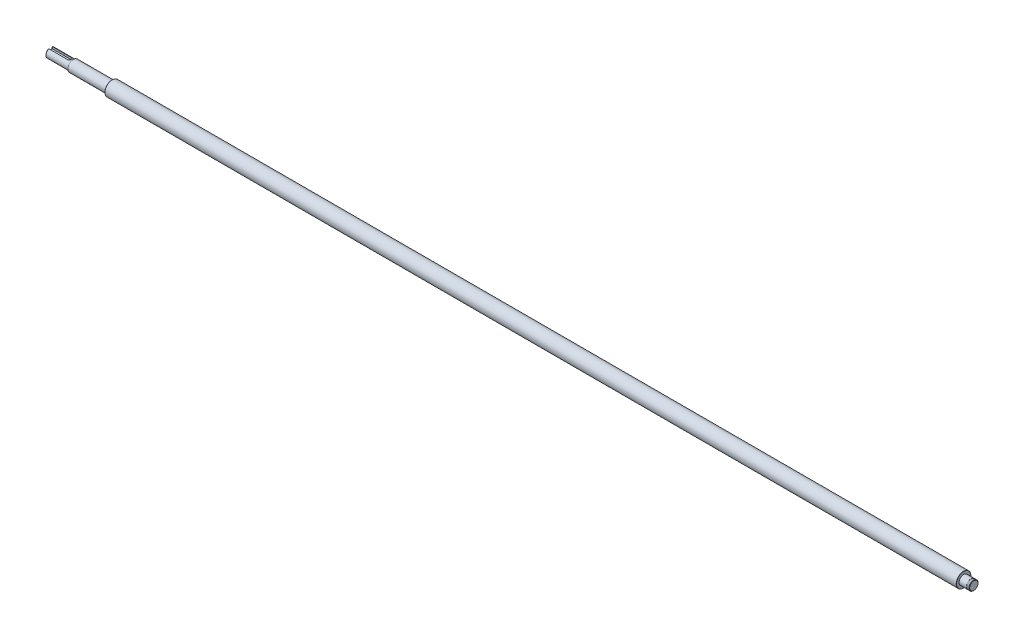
from build123d import *

# Parameters (mm, degrees)
CHAMFER1_SIZE      = 0.5
CHAMFER2_SIZE      = 0.2
CUT_EXTRUDE1_DEPTH = 2.5


with BuildPart() as part:
    # Sketch1 → Revolve1 (revolve)
    with BuildSketch(Plane.XY):
        Polygon((-23.245033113, 0), (-23.245033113, 5), (1.754966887, 5), (1.754966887, 6), (43.754966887, 6), (43.754966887, 7.9), (965.754966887, 7.9), (965.754966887, 5), (973.754966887, 5), (973.754966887, 4.8), (974.904966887, 4.8), (974.904966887, 5), (976.754966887, 5), (976.754966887, 0), align=None)
    revolve(axis=Axis((976.754966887, 0, 0), (-1, 0, 0)))

    # Chamfer1
    chamfer1_edges = [part.edges().sort_by_distance(p)[0] for p in [
        (976.754966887, -5, 0),
        (-23.245033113, -5, 0),
    ]]
    chamfer(chamfer1_edges, length=CHAMFER1_SIZE)

    # Chamfer2
    chamfer2_edges = [part.edges().sort_by_distance(p)[0] for p in [
        (965.754966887, -7.9, 0),
        (43.754966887, -7.9, 0),
        (1.754966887, -6, 0),
    ]]
    chamfer(chamfer2_edges, length=CHAMFER2_SIZE)

    # Sketch2 → Cut-Extrude1 (cut)
    with BuildSketch(Plane(origin=(0, 5, 0), x_dir=(1, 0, 0), z_dir=(0, 1, 0))):
        with BuildLine():
            Line((-23.245033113, 2), (-2.245033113, 2))
            ThreePointArc((-2.245033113, 2), (-0.245033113, 0), (-2.245033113, -2))
            Line((-2.245033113, -2), (-23.245033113, -2))
            ThreePointArc((-23.245033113, -2), (-25.245033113, 0), (-23.245033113, 2))
        make_face()
    extrude(amount=-CUT_EXTRUDE1_DEPTH, mode=Mode.SUBTRACT)


solid = part.part
